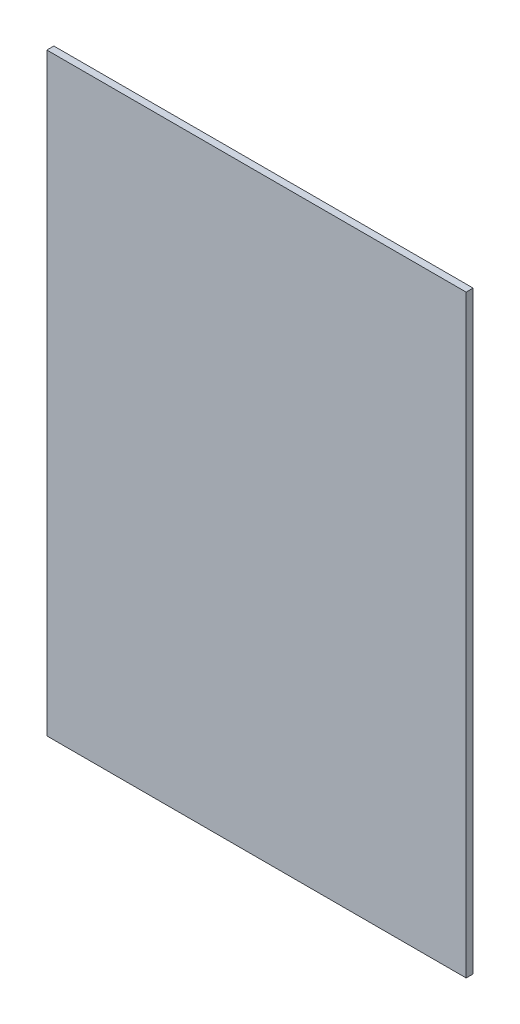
ISO-10303-21;
HEADER;
FILE_DESCRIPTION(('STEP AP214'),'2;1');
FILE_NAME('part.step','',(''),(''),'','','');
FILE_SCHEMA(('AUTOMOTIVE_DESIGN { 1 0 10303 214 1 1 1 1 }'));
ENDSEC;
DATA;
#1=APPLICATION_CONTEXT('core data for automotive mechanical design processes');
#2=APPLICATION_PROTOCOL_DEFINITION('international standard','automotive_design',2000,#1);
#3=PRODUCT_CONTEXT('',#1,'mechanical');
#4=PRODUCT('Part','Part','',(#3));
#5=PRODUCT_RELATED_PRODUCT_CATEGORY('part','',(#4));
#6=PRODUCT_DEFINITION_FORMATION('','',#4);
#7=PRODUCT_DEFINITION_CONTEXT('part definition',#1,'design');
#8=PRODUCT_DEFINITION('design','',#6,#7);
#9=PRODUCT_DEFINITION_SHAPE('','',#8);
#10=(LENGTH_UNIT() NAMED_UNIT(*) SI_UNIT(.MILLI.,.METRE.));
#11=(NAMED_UNIT(*) PLANE_ANGLE_UNIT() SI_UNIT($,.RADIAN.));
#12=(NAMED_UNIT(*) SI_UNIT($,.STERADIAN.) SOLID_ANGLE_UNIT());
#13=UNCERTAINTY_MEASURE_WITH_UNIT(LENGTH_MEASURE(1.E-05),#10,'distance_accuracy_value','');
#14=(GEOMETRIC_REPRESENTATION_CONTEXT(3) GLOBAL_UNCERTAINTY_ASSIGNED_CONTEXT((#13)) GLOBAL_UNIT_ASSIGNED_CONTEXT((#10,
#11,#12)) REPRESENTATION_CONTEXT('',''));
#15=CARTESIAN_POINT('',(0.,0.,0.));
#16=DIRECTION('',(0.,0.,1.));
#17=DIRECTION('',(1.,0.,0.));
#18=AXIS2_PLACEMENT_3D('',#15,#16,#17);
#19=CARTESIAN_POINT('',(76.2,107.95,2.54));
#20=DIRECTION('',(-1.,0.,0.));
#21=DIRECTION('',(0.,-1.,0.));
#22=AXIS2_PLACEMENT_3D('',#19,#20,#21);
#23=PLANE('',#22);
#24=DIRECTION('',(0.,1.,0.));
#25=VECTOR('',#24,1.);
#26=CARTESIAN_POINT('',(76.2,107.95,0.));
#27=LINE('',#26,#25);
#28=CARTESIAN_POINT('',(76.2,-107.95,0.));
#29=VERTEX_POINT('',#28);
#30=CARTESIAN_POINT('',(76.2,107.95,0.));
#31=VERTEX_POINT('',#30);
#32=EDGE_CURVE('E107',#29,#31,#27,.T.);
#33=ORIENTED_EDGE('',*,*,#32,.T.);
#34=DIRECTION('',(0.,0.,-1.));
#35=VECTOR('',#34,1.);
#36=CARTESIAN_POINT('',(76.2,107.95,2.54));
#37=LINE('',#36,#35);
#38=CARTESIAN_POINT('',(76.2,107.95,2.54));
#39=VERTEX_POINT('',#38);
#40=EDGE_CURVE('E11',#39,#31,#37,.T.);
#41=ORIENTED_EDGE('',*,*,#40,.F.);
#42=DIRECTION('',(0.,1.,0.));
#43=VECTOR('',#42,1.);
#44=CARTESIAN_POINT('',(76.2,107.95,2.54));
#45=LINE('',#44,#43);
#46=CARTESIAN_POINT('',(76.2,-107.95,2.54));
#47=VERTEX_POINT('',#46);
#48=EDGE_CURVE('E91',#47,#39,#45,.T.);
#49=ORIENTED_EDGE('',*,*,#48,.F.);
#50=DIRECTION('',(0.,0.,-1.));
#51=VECTOR('',#50,1.);
#52=CARTESIAN_POINT('',(76.2,-107.95,2.54));
#53=LINE('',#52,#51);
#54=EDGE_CURVE('E103',#47,#29,#53,.T.);
#55=ORIENTED_EDGE('',*,*,#54,.T.);
#56=EDGE_LOOP('',(#33,#41,#49,#55));
#57=FACE_BOUND('',#56,.T.);
#58=ADVANCED_FACE('F39',(#57),#23,.F.);
#59=CARTESIAN_POINT('',(-76.2,107.95,2.54));
#60=DIRECTION('',(0.,-1.,0.));
#61=DIRECTION('',(0.,0.,-1.));
#62=AXIS2_PLACEMENT_3D('',#59,#60,#61);
#63=PLANE('',#62);
#64=DIRECTION('',(-1.,0.,0.));
#65=VECTOR('',#64,1.);
#66=CARTESIAN_POINT('',(-76.2,107.95,0.));
#67=LINE('',#66,#65);
#68=CARTESIAN_POINT('',(-76.2,107.95,0.));
#69=VERTEX_POINT('',#68);
#70=EDGE_CURVE('E96',#31,#69,#67,.T.);
#71=ORIENTED_EDGE('',*,*,#70,.T.);
#72=DIRECTION('',(0.,0.,-1.));
#73=VECTOR('',#72,1.);
#74=CARTESIAN_POINT('',(-76.2,107.95,2.54));
#75=LINE('',#74,#73);
#76=CARTESIAN_POINT('',(-76.2,107.95,2.54));
#77=VERTEX_POINT('',#76);
#78=EDGE_CURVE('E48',#77,#69,#75,.T.);
#79=ORIENTED_EDGE('',*,*,#78,.F.);
#80=DIRECTION('',(-1.,0.,0.));
#81=VECTOR('',#80,1.);
#82=CARTESIAN_POINT('',(-76.2,107.95,2.54));
#83=LINE('',#82,#81);
#84=EDGE_CURVE('E86',#39,#77,#83,.T.);
#85=ORIENTED_EDGE('',*,*,#84,.F.);
#86=ORIENTED_EDGE('',*,*,#40,.T.);
#87=EDGE_LOOP('',(#71,#79,#85,#86));
#88=FACE_BOUND('',#87,.T.);
#89=ADVANCED_FACE('F95',(#88),#63,.F.);
#90=CARTESIAN_POINT('',(-76.2,107.95,2.54));
#91=DIRECTION('',(1.,0.,0.));
#92=DIRECTION('',(0.,1.,0.));
#93=AXIS2_PLACEMENT_3D('',#90,#91,#92);
#94=PLANE('',#93);
#95=DIRECTION('',(0.,-1.,0.));
#96=VECTOR('',#95,1.);
#97=CARTESIAN_POINT('',(-76.2,107.95,0.));
#98=LINE('',#97,#96);
#99=CARTESIAN_POINT('',(-76.2,-107.95,0.));
#100=VERTEX_POINT('',#99);
#101=EDGE_CURVE('E73',#69,#100,#98,.T.);
#102=ORIENTED_EDGE('',*,*,#101,.T.);
#103=DIRECTION('',(0.,0.,-1.));
#104=VECTOR('',#103,1.);
#105=CARTESIAN_POINT('',(-76.2,-107.95,2.54));
#106=LINE('',#105,#104);
#107=CARTESIAN_POINT('',(-76.2,-107.95,2.54));
#108=VERTEX_POINT('',#107);
#109=EDGE_CURVE('E98',#108,#100,#106,.T.);
#110=ORIENTED_EDGE('',*,*,#109,.F.);
#111=DIRECTION('',(0.,-1.,0.));
#112=VECTOR('',#111,1.);
#113=CARTESIAN_POINT('',(-76.2,107.95,2.54));
#114=LINE('',#113,#112);
#115=EDGE_CURVE('E89',#77,#108,#114,.T.);
#116=ORIENTED_EDGE('',*,*,#115,.F.);
#117=ORIENTED_EDGE('',*,*,#78,.T.);
#118=EDGE_LOOP('',(#102,#110,#116,#117));
#119=FACE_BOUND('',#118,.T.);
#120=ADVANCED_FACE('F99',(#119),#94,.F.);
#121=CARTESIAN_POINT('',(-76.2,-107.95,2.54));
#122=DIRECTION('',(0.,1.,0.));
#123=DIRECTION('',(0.,0.,1.));
#124=AXIS2_PLACEMENT_3D('',#121,#122,#123);
#125=PLANE('',#124);
#126=DIRECTION('',(1.,0.,0.));
#127=VECTOR('',#126,1.);
#128=CARTESIAN_POINT('',(-76.2,-107.95,0.));
#129=LINE('',#128,#127);
#130=EDGE_CURVE('E79',#100,#29,#129,.T.);
#131=ORIENTED_EDGE('',*,*,#130,.T.);
#132=ORIENTED_EDGE('',*,*,#54,.F.);
#133=DIRECTION('',(1.,0.,0.));
#134=VECTOR('',#133,1.);
#135=CARTESIAN_POINT('',(-76.2,-107.95,2.54));
#136=LINE('',#135,#134);
#137=EDGE_CURVE('E56',#108,#47,#136,.T.);
#138=ORIENTED_EDGE('',*,*,#137,.F.);
#139=ORIENTED_EDGE('',*,*,#109,.T.);
#140=EDGE_LOOP('',(#131,#132,#138,#139));
#141=FACE_BOUND('',#140,.T.);
#142=ADVANCED_FACE('F120',(#141),#125,.F.);
#143=CARTESIAN_POINT('',(0.,0.,2.54));
#144=DIRECTION('',(0.,0.,1.));
#145=DIRECTION('',(1.,0.,0.));
#146=AXIS2_PLACEMENT_3D('',#143,#144,#145);
#147=PLANE('',#146);
#148=ORIENTED_EDGE('',*,*,#48,.T.);
#149=ORIENTED_EDGE('',*,*,#84,.T.);
#150=ORIENTED_EDGE('',*,*,#115,.T.);
#151=ORIENTED_EDGE('',*,*,#137,.T.);
#152=EDGE_LOOP('',(#148,#149,#150,#151));
#153=FACE_BOUND('',#152,.T.);
#154=ADVANCED_FACE('F87',(#153),#147,.T.);
#155=CARTESIAN_POINT('',(0.,0.,0.));
#156=DIRECTION('',(0.,0.,1.));
#157=DIRECTION('',(1.,0.,0.));
#158=AXIS2_PLACEMENT_3D('',#155,#156,#157);
#159=PLANE('',#158);
#160=ORIENTED_EDGE('',*,*,#32,.F.);
#161=ORIENTED_EDGE('',*,*,#130,.F.);
#162=ORIENTED_EDGE('',*,*,#101,.F.);
#163=ORIENTED_EDGE('',*,*,#70,.F.);
#164=EDGE_LOOP('',(#160,#161,#162,#163));
#165=FACE_BOUND('',#164,.T.);
#166=ADVANCED_FACE('F123',(#165),#159,.F.);
#167=CLOSED_SHELL('',(#58,#89,#120,#142,#154,#166));
#168=MANIFOLD_SOLID_BREP('B2',#167);
#169=ADVANCED_BREP_SHAPE_REPRESENTATION('',(#18,#168),#14);
#170=SHAPE_DEFINITION_REPRESENTATION(#9,#169);
ENDSEC;
END-ISO-10303-21;
